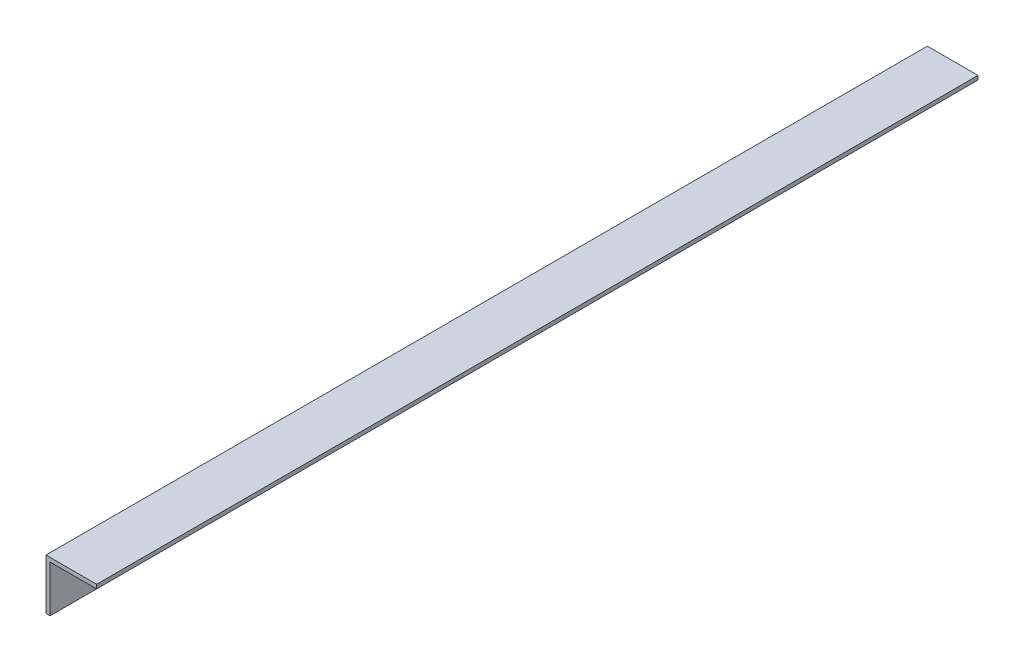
from build123d import *

# Parameters (mm, degrees)
BASE_EXTRUSION_DEPTH = 870


with BuildPart() as part:
    # Esquisse2 → Base-Extrusion (new body)
    with BuildSketch(Plane.XY):
        Polygon((0, 0), (50, 0), (50, -4), (4, -4), (4, -50), (0, -50), align=None)
    extrude(amount=-BASE_EXTRUSION_DEPTH)


solid = part.part
